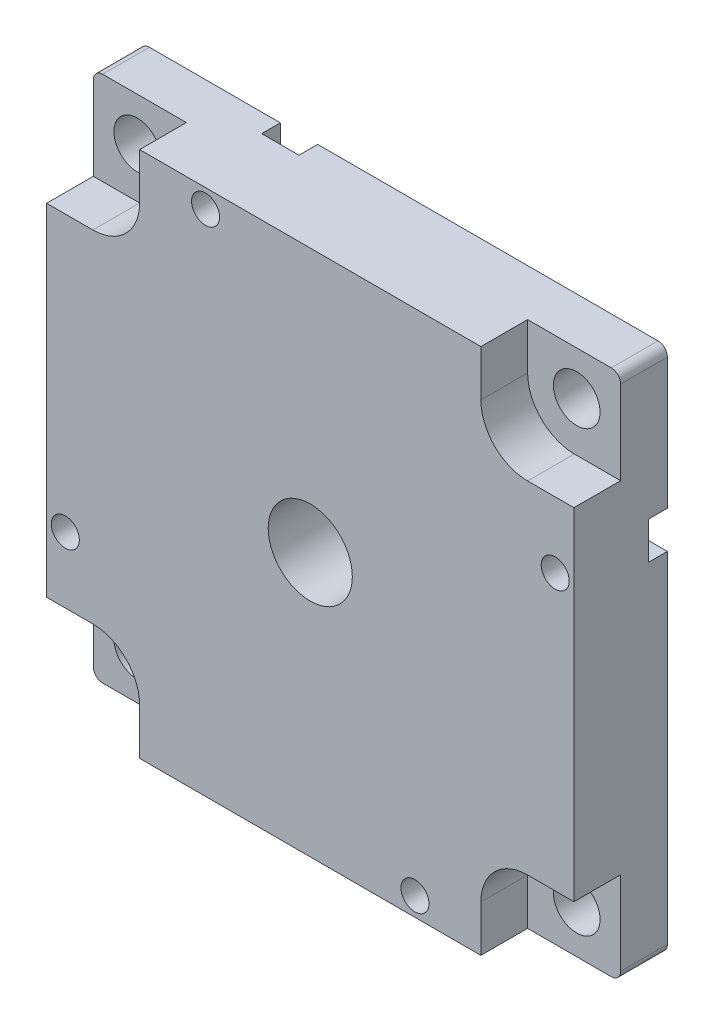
from build123d import *

# Parameters (mm, degrees)
SKETCH_2_W               = 56.4
SKETCH_2_H               = 56.4
EXTRUDE_1_DEPTH          = 5
SKETCH_3_R               = 20
SKETCH_3_R_2             = 19
CUT_EXTRUDE_1_DEPTH      = 0.5
EXTRUDE_START            = 1.6
SKETCH_4_R               = 19
EXTRUDE_2_DEPTH          = 1.6
SKETCH_5_R               = 4.5
CUT_EXTRUDE_2_DEPTH      = 80
FILLET_1_R               = 1
EXTRUDE_3_DEPTH          = 5
CUT_EXTRUDE_START        = -5.5
SKETCH_7_R               = 4.5
CUT_EXTRUDE_3_DEPTH      = 5.5
SKETCH_8_R               = 2.5
CUT_EXTRUDE_4_DEPTH      = 5.5
PATTERN_CIRCULAR_1_COUNT = 4
FILLET_2_R               = 5
CUT_EXTRUDE_5_DEPTH      = 2
PATTERN_CIRCULAR_2_COUNT = 4
SKETCH_10_R              = 1.5
CUT_EXTRUDE_6_DEPTH      = 20
PATTERN_CIRCULAR_3_COUNT = 4


with BuildPart() as part:
    # Sketch 2 → Extrude 1 (new body)
    with BuildSketch(Plane.XY):
        Rectangle(SKETCH_2_W, SKETCH_2_H)
    extrude(amount=EXTRUDE_1_DEPTH)

    # Sketch 3 → Cut-Extrude 1 (cut)
    with BuildSketch(Plane(origin=(0, 0, 0), x_dir=(-1, 0, 0), z_dir=(0, 0, -1))):
        Circle(SKETCH_3_R)
        Circle(SKETCH_3_R_2, mode=Mode.SUBTRACT)
    extrude(amount=-CUT_EXTRUDE_1_DEPTH, mode=Mode.SUBTRACT)

    # Sketch 4 → Extrude 2 (add)
    with BuildSketch(Plane(origin=(0, 0, 0), x_dir=(-1, 0, 0), z_dir=(0, 0, -1)).offset(EXTRUDE_START)):
        Circle(SKETCH_4_R)
    extrude(amount=-EXTRUDE_2_DEPTH)

    # Sketch 5 → Cut-Extrude 2 (cut)
    with BuildSketch(Plane(origin=(0, 0, -1.6), x_dir=(-1, 0, 0), z_dir=(0, 0, -1))):
        Circle(SKETCH_5_R)
    extrude(amount=-CUT_EXTRUDE_2_DEPTH, mode=Mode.SUBTRACT)

    # Fillet 1
    fillet_1_edges = [part.edges().sort_by_distance(p)[0] for p in [
        (-28.2, 28.2, 2.5),
        (28.2, 28.2, 2.5),
        (28.2, -28.2, 2.5),
        (-28.2, -28.2, 2.5),
    ]]
    fillet(fillet_1_edges, radius=FILLET_1_R)

    # Sketch 6 → Extrude 3 (add)
    with BuildSketch(Plane.XY.offset(5)):
        Polygon((28.2, -18.25), (18.25, -18.25), (18.25, -28.2), (-18.25, -28.2), (-18.25, -18.25), (-28.2, -18.25), (-28.2, 18.25), (-18.25, 18.25), (-18.25, 28.2), (18.25, 28.2), (18.25, 18.25), (28.2, 18.25), align=None)
    extrude(amount=EXTRUDE_3_DEPTH)

    # Sketch 7 → Cut-Extrude 3 (cut)
    with BuildSketch(Plane.XY.offset(10).offset(CUT_EXTRUDE_START)):
        with Locations(Location((0, 0, 0), (0, 0, 180))):
            Circle(SKETCH_7_R)
    extrude(amount=CUT_EXTRUDE_3_DEPTH, mode=Mode.SUBTRACT)

    # Sketch 8 → Cut-Extrude 4 (cut)
    with BuildSketch(Plane(origin=(0, 0, 0), x_dir=(-1, 0, 0), z_dir=(0, 0, -1))):
        with Locations((-23.5, 23.5)):
            Circle(SKETCH_8_R)
    cut_extrude_4 = extrude(amount=-CUT_EXTRUDE_4_DEPTH, mode=Mode.SUBTRACT)

    # Pattern Circular 1: Cut-Extrude 4 ×4 about axis
    pattern_circular_1_axis = Axis((0, 0, 0), (0, 0, 1))
    for i in range(1, PATTERN_CIRCULAR_1_COUNT):
        add(cut_extrude_4.rotate(pattern_circular_1_axis, i * 360 / PATTERN_CIRCULAR_1_COUNT), mode=Mode.SUBTRACT)

    # Fillet 2
    fillet_2_edges = [part.edges().sort_by_distance(p)[0] for p in [
        (-18.25, -18.25, 7.5),
        (18.25, -18.25, 7.5),
        (18.25, 18.25, 7.5),
        (-18.25, 18.25, 7.5),
    ]]
    fillet(fillet_2_edges, radius=FILLET_2_R)

    # Sketch 9 → Cut-Extrude 5 (cut)
    with BuildSketch(Plane(origin=(0, 0, 0), x_dir=(-1, 0, 0), z_dir=(0, 0, -1))):
        with BuildLine():
            Line((9.2, 28.2), (13.2, 28.2))
            Line((13.2, 28.2), (13.2, 26.2))
            ThreePointArc((13.2, 26.2), (11.2, 24.2), (9.2, 26.2))
            Line((9.2, 26.2), (9.2, 28.2))
        make_face()
    cut_extrude_5 = extrude(amount=-CUT_EXTRUDE_5_DEPTH, mode=Mode.SUBTRACT)

    # Pattern Circular 2: Cut-Extrude 5 ×4 about axis
    pattern_circular_2_axis = Axis((0, 0, 0), (0, 0, 1))
    for i in range(1, PATTERN_CIRCULAR_2_COUNT):
        add(cut_extrude_5.rotate(pattern_circular_2_axis, i * 360 / PATTERN_CIRCULAR_2_COUNT), mode=Mode.SUBTRACT)

    # Sketch 10 → Cut-Extrude 6 (cut)
    with BuildSketch(Plane(origin=(0, 0, 2), x_dir=(-1, 0, 0), z_dir=(0, 0, -1))):
        with Locations((11.2, 26.2)):
            Circle(SKETCH_10_R)
    cut_extrude_6 = extrude(amount=-CUT_EXTRUDE_6_DEPTH, mode=Mode.SUBTRACT)

    # Pattern Circular 3: Cut-Extrude 6 ×4 about axis
    pattern_circular_3_axis = Axis((0, 0, 0), (0, 0, 1))
    for i in range(1, PATTERN_CIRCULAR_3_COUNT):
        add(cut_extrude_6.rotate(pattern_circular_3_axis, i * 360 / PATTERN_CIRCULAR_3_COUNT), mode=Mode.SUBTRACT)


solid = part.part
